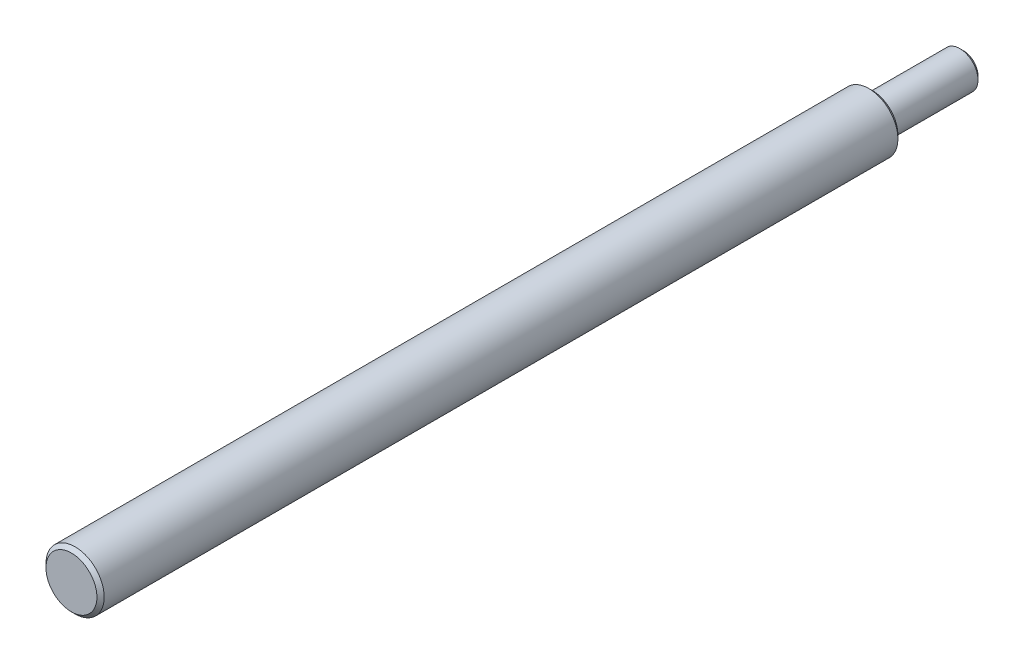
ISO-10303-21;
HEADER;
FILE_DESCRIPTION(('STEP AP214'),'2;1');
FILE_NAME('part.step','',(''),(''),'','','');
FILE_SCHEMA(('AUTOMOTIVE_DESIGN { 1 0 10303 214 1 1 1 1 }'));
ENDSEC;
DATA;
#1=APPLICATION_CONTEXT('core data for automotive mechanical design processes');
#2=APPLICATION_PROTOCOL_DEFINITION('international standard','automotive_design',2000,#1);
#3=PRODUCT_CONTEXT('',#1,'mechanical');
#4=PRODUCT('Part','Part','',(#3));
#5=PRODUCT_RELATED_PRODUCT_CATEGORY('part','',(#4));
#6=PRODUCT_DEFINITION_FORMATION('','',#4);
#7=PRODUCT_DEFINITION_CONTEXT('part definition',#1,'design');
#8=PRODUCT_DEFINITION('design','',#6,#7);
#9=PRODUCT_DEFINITION_SHAPE('','',#8);
#10=(LENGTH_UNIT() NAMED_UNIT(*) SI_UNIT(.MILLI.,.METRE.));
#11=(NAMED_UNIT(*) PLANE_ANGLE_UNIT() SI_UNIT($,.RADIAN.));
#12=(NAMED_UNIT(*) SI_UNIT($,.STERADIAN.) SOLID_ANGLE_UNIT());
#13=UNCERTAINTY_MEASURE_WITH_UNIT(LENGTH_MEASURE(1.E-05),#10,'distance_accuracy_value','');
#14=(GEOMETRIC_REPRESENTATION_CONTEXT(3) GLOBAL_UNCERTAINTY_ASSIGNED_CONTEXT((#13)) GLOBAL_UNIT_ASSIGNED_CONTEXT((#10,
#11,#12)) REPRESENTATION_CONTEXT('',''));
#15=CARTESIAN_POINT('',(0.,0.,0.));
#16=DIRECTION('',(0.,0.,1.));
#17=DIRECTION('',(1.,0.,0.));
#18=AXIS2_PLACEMENT_3D('',#15,#16,#17);
#19=CARTESIAN_POINT('',(0.,0.,220.));
#20=DIRECTION('',(0.,0.,-1.));
#21=DIRECTION('',(-1.,0.,0.));
#22=AXIS2_PLACEMENT_3D('',#19,#20,#21);
#23=CYLINDRICAL_SURFACE('',#22,8.);
#24=CARTESIAN_POINT('',(0.,0.,219.));
#25=DIRECTION('',(0.,0.,1.));
#26=DIRECTION('',(1.,0.,0.));
#27=AXIS2_PLACEMENT_3D('',#24,#25,#26);
#28=CIRCLE('',#27,8.);
#29=CARTESIAN_POINT('',(8.,0.,219.));
#30=VERTEX_POINT('',#29);
#31=EDGE_CURVE('E52',#30,#30,#28,.F.);
#32=ORIENTED_EDGE('',*,*,#31,.T.);
#33=EDGE_LOOP('',(#32));
#34=FACE_BOUND('',#33,.T.);
#35=CARTESIAN_POINT('',(0.,0.,1.00000000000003));
#36=DIRECTION('',(0.,0.,1.));
#37=DIRECTION('',(1.,0.,0.));
#38=AXIS2_PLACEMENT_3D('',#35,#36,#37);
#39=CIRCLE('',#38,8.);
#40=CARTESIAN_POINT('',(8.,0.,1.00000000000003));
#41=VERTEX_POINT('',#40);
#42=EDGE_CURVE('E57',#41,#41,#39,.T.);
#43=ORIENTED_EDGE('',*,*,#42,.T.);
#44=EDGE_LOOP('',(#43));
#45=FACE_BOUND('',#44,.T.);
#46=ADVANCED_FACE('F37',(#34,#45),#23,.T.);
#47=CARTESIAN_POINT('',(0.,0.,220.));
#48=DIRECTION('',(0.,0.,1.));
#49=DIRECTION('',(1.,0.,0.));
#50=AXIS2_PLACEMENT_3D('',#47,#48,#49);
#51=PLANE('',#50);
#52=CARTESIAN_POINT('',(0.,0.,220.));
#53=DIRECTION('',(0.,0.,1.));
#54=DIRECTION('',(1.,0.,0.));
#55=AXIS2_PLACEMENT_3D('',#52,#53,#54);
#56=CIRCLE('',#55,7.00000000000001);
#57=CARTESIAN_POINT('',(7.00000000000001,0.,220.));
#58=VERTEX_POINT('',#57);
#59=EDGE_CURVE('E60',#58,#58,#56,.T.);
#60=ORIENTED_EDGE('',*,*,#59,.T.);
#61=EDGE_LOOP('',(#60));
#62=FACE_BOUND('',#61,.T.);
#63=ADVANCED_FACE('F71',(#62),#51,.T.);
#64=CARTESIAN_POINT('',(0.,0.,0.));
#65=DIRECTION('',(0.,0.,1.));
#66=DIRECTION('',(1.,0.,0.));
#67=AXIS2_PLACEMENT_3D('',#64,#65,#66);
#68=PLANE('',#67);
#69=CARTESIAN_POINT('',(0.,0.,0.));
#70=DIRECTION('',(0.,0.,1.));
#71=DIRECTION('',(1.,0.,0.));
#72=AXIS2_PLACEMENT_3D('',#69,#70,#71);
#73=CIRCLE('',#72,6.99999999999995);
#74=CARTESIAN_POINT('',(6.99999999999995,0.,0.));
#75=VERTEX_POINT('',#74);
#76=EDGE_CURVE('E10',#75,#75,#73,.F.);
#77=ORIENTED_EDGE('',*,*,#76,.T.);
#78=EDGE_LOOP('',(#77));
#79=FACE_BOUND('',#78,.T.);
#80=CARTESIAN_POINT('',(0.,0.,0.));
#81=DIRECTION('',(0.,0.,1.));
#82=DIRECTION('',(1.,0.,0.));
#83=AXIS2_PLACEMENT_3D('',#80,#81,#82);
#84=CIRCLE('',#83,5.);
#85=CARTESIAN_POINT('',(5.,0.,0.));
#86=VERTEX_POINT('',#85);
#87=EDGE_CURVE('E63',#86,#86,#84,.F.);
#88=ORIENTED_EDGE('',*,*,#87,.F.);
#89=EDGE_LOOP('',(#88));
#90=FACE_BOUND('',#89,.T.);
#91=ADVANCED_FACE('F69',(#79,#90),#68,.F.);
#92=CARTESIAN_POINT('',(0.,0.,-25.));
#93=DIRECTION('',(0.,0.,1.));
#94=DIRECTION('',(1.,0.,0.));
#95=AXIS2_PLACEMENT_3D('',#92,#93,#94);
#96=CYLINDRICAL_SURFACE('',#95,5.);
#97=CARTESIAN_POINT('',(0.,0.,-24.));
#98=DIRECTION('',(0.,0.,-1.));
#99=DIRECTION('',(-1.,0.,0.));
#100=AXIS2_PLACEMENT_3D('',#97,#98,#99);
#101=CIRCLE('',#100,5.);
#102=CARTESIAN_POINT('',(-5.,0.,-24.));
#103=VERTEX_POINT('',#102);
#104=EDGE_CURVE('E44',#103,#103,#101,.F.);
#105=ORIENTED_EDGE('',*,*,#104,.T.);
#106=EDGE_LOOP('',(#105));
#107=FACE_BOUND('',#106,.T.);
#108=ORIENTED_EDGE('',*,*,#87,.T.);
#109=EDGE_LOOP('',(#108));
#110=FACE_BOUND('',#109,.T.);
#111=ADVANCED_FACE('F67',(#107,#110),#96,.T.);
#112=CARTESIAN_POINT('',(0.,0.,-25.));
#113=DIRECTION('',(0.,0.,-1.));
#114=DIRECTION('',(-1.,0.,0.));
#115=AXIS2_PLACEMENT_3D('',#112,#113,#114);
#116=PLANE('',#115);
#117=CARTESIAN_POINT('',(0.,0.,-25.));
#118=DIRECTION('',(0.,0.,-1.));
#119=DIRECTION('',(-1.,0.,0.));
#120=AXIS2_PLACEMENT_3D('',#117,#118,#119);
#121=CIRCLE('',#120,3.99999999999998);
#122=CARTESIAN_POINT('',(-3.99999999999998,0.,-25.));
#123=VERTEX_POINT('',#122);
#124=EDGE_CURVE('E48',#123,#123,#121,.T.);
#125=ORIENTED_EDGE('',*,*,#124,.T.);
#126=EDGE_LOOP('',(#125));
#127=FACE_BOUND('',#126,.T.);
#128=ADVANCED_FACE('F77',(#127),#116,.T.);
#129=CARTESIAN_POINT('',(0.,0.,220.));
#130=DIRECTION('',(0.,0.,-1.));
#131=DIRECTION('',(-1.,0.,0.));
#132=AXIS2_PLACEMENT_3D('',#129,#130,#131);
#133=CONICAL_SURFACE('',#132,7.00000000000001,0.785398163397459);
#134=ORIENTED_EDGE('',*,*,#31,.F.);
#135=EDGE_LOOP('',(#134));
#136=FACE_BOUND('',#135,.T.);
#137=ORIENTED_EDGE('',*,*,#59,.F.);
#138=EDGE_LOOP('',(#137));
#139=FACE_BOUND('',#138,.T.);
#140=ADVANCED_FACE('F88',(#136,#139),#133,.T.);
#141=CARTESIAN_POINT('',(0.,0.,-25.));
#142=DIRECTION('',(0.,0.,1.));
#143=DIRECTION('',(1.,0.,0.));
#144=AXIS2_PLACEMENT_3D('',#141,#142,#143);
#145=CONICAL_SURFACE('',#144,3.99999999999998,0.785398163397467);
#146=ORIENTED_EDGE('',*,*,#104,.F.);
#147=EDGE_LOOP('',(#146));
#148=FACE_BOUND('',#147,.T.);
#149=ORIENTED_EDGE('',*,*,#124,.F.);
#150=EDGE_LOOP('',(#149));
#151=FACE_BOUND('',#150,.T.);
#152=ADVANCED_FACE('F90',(#148,#151),#145,.T.);
#153=CARTESIAN_POINT('',(0.,0.,1.00000000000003));
#154=DIRECTION('',(0.,0.,1.));
#155=DIRECTION('',(1.,0.,0.));
#156=AXIS2_PLACEMENT_3D('',#153,#154,#155);
#157=CONICAL_SURFACE('',#156,8.,0.785398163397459);
#158=ORIENTED_EDGE('',*,*,#76,.F.);
#159=EDGE_LOOP('',(#158));
#160=FACE_BOUND('',#159,.T.);
#161=ORIENTED_EDGE('',*,*,#42,.F.);
#162=EDGE_LOOP('',(#161));
#163=FACE_BOUND('',#162,.T.);
#164=ADVANCED_FACE('F39',(#160,#163),#157,.T.);
#165=CLOSED_SHELL('',(#46,#63,#91,#111,#128,#140,#152,#164));
#166=MANIFOLD_SOLID_BREP('B2',#165);
#167=ADVANCED_BREP_SHAPE_REPRESENTATION('',(#18,#166),#14);
#168=SHAPE_DEFINITION_REPRESENTATION(#9,#167);
ENDSEC;
END-ISO-10303-21;
